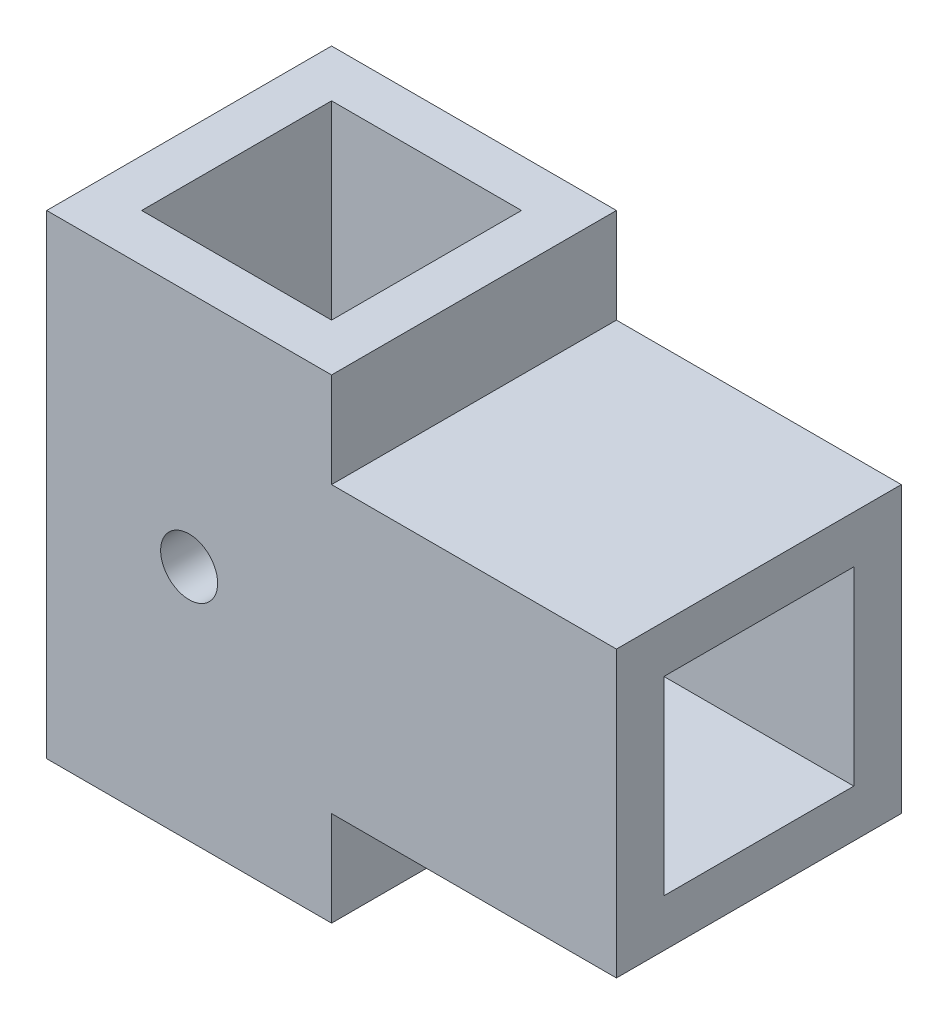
from build123d import *

# Parameters (mm, degrees)
SKETCH1_R           = 3
BOSS_EXTRUDE1_DEPTH = 15
SKETCH2_W           = 20
SKETCH2_H           = 20
CUT_EXTRUDE1_DEPTH  = 59
SKETCH3_W           = 20
SKETCH3_H           = 20
CUT_EXTRUDE2_DEPTH  = 25


with BuildPart() as part:
    # Sketch1 → Boss-Extrude1 (new, symmetric)
    with BuildSketch(Plane.XY):
        Polygon((15, 15), (15, 25), (-15, 25), (-15, -25), (15, -25), (15, -15), (45, -15), (45, 15), align=None)
        Circle(SKETCH1_R, mode=Mode.SUBTRACT)
    extrude(amount=BOSS_EXTRUDE1_DEPTH, both=True)

    # Sketch2 → Cut-Extrude1 (cut)
    with BuildSketch(Plane(origin=(0, 25, 0), x_dir=(1, 0, 0), z_dir=(0, 1, 0))):
        Rectangle(SKETCH2_W, SKETCH2_H)
    extrude(amount=-CUT_EXTRUDE1_DEPTH, mode=Mode.SUBTRACT)

    # Sketch3 → Cut-Extrude2 (cut)
    with BuildSketch(Plane(origin=(45, 0, 0), x_dir=(0, 0, -1), z_dir=(1, 0, 0))):
        Rectangle(SKETCH3_W, SKETCH3_H)
    extrude(amount=-CUT_EXTRUDE2_DEPTH, mode=Mode.SUBTRACT)


solid = part.part
